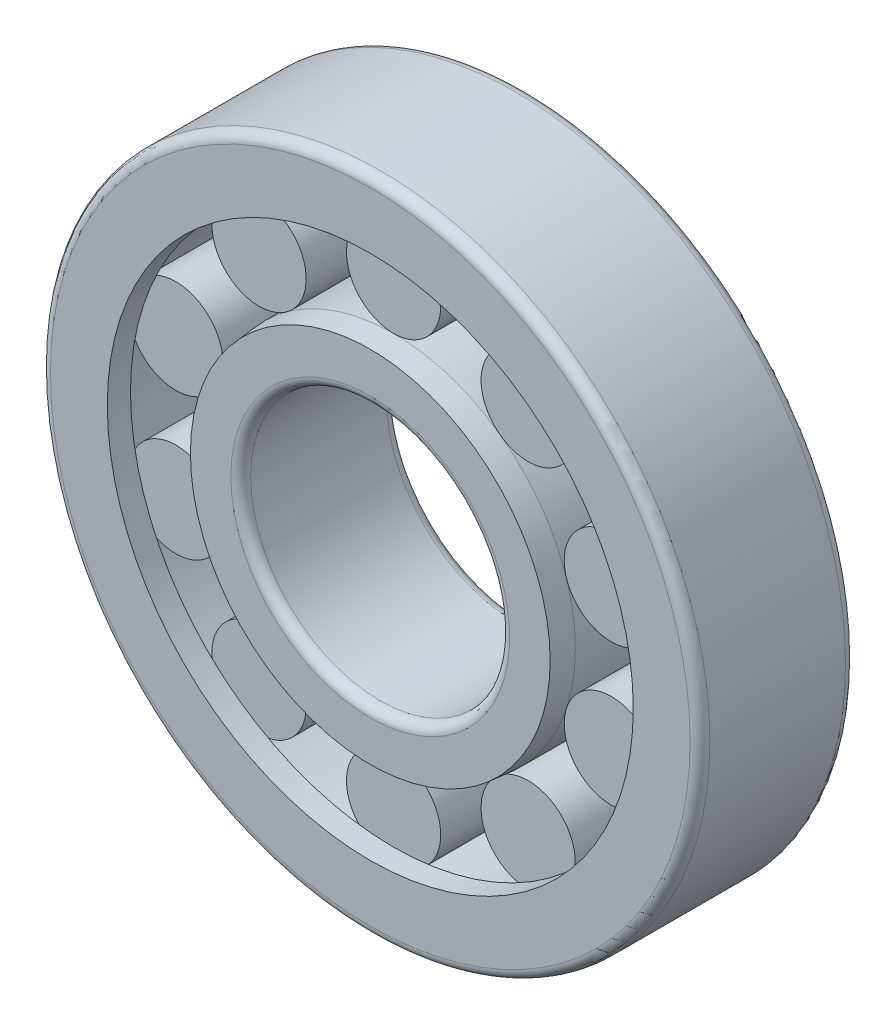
from build123d import *

# Parameters (mm, degrees)
BASESKE_W            = 23.1
BASESKE_H            = 10
FILLET1_R            = 2.1
CIRPATTERNBALL_COUNT = 10


with BuildPart() as part:
    # BaseSke → Roller (revolve)
    with BuildSketch(Plane(origin=(0, 0, 0), x_dir=(0, 0, -1), z_dir=(1, 0, 0)), mode=Mode.PRIVATE) as roller_sk:
        with Locations((0, 43.6)):
            Rectangle(BASESKE_W, BASESKE_H)
    roller = revolve(roller_sk.sketch.rotate(Axis((0, 48.6, 11.55), (0, 0, -1)), 270), axis=Axis((0, 48.6, 11.55), (0, 0, -1)))

    # OuterRaceSke → OuterRace (revolve)
    with BuildSketch(Plane(origin=(0, 0, 0), x_dir=(0, 0, -1), z_dir=(1, 0, 0)), mode=Mode.PRIVATE) as outerrace_sk:
        Polygon((-16.5, 70), (16.5, 70), (16.5, 55.833333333), (11.575, 55.833333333), (11.575, 58.58), (-11.575, 58.58), (-11.575, 55.833333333), (-16.5, 55.833333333), align=None)
    revolve(outerrace_sk.sketch.rotate(Axis((0, 0, 50.391616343), (0, 0, -1)), 90), axis=Axis((0, 0, 50.391616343), (0, 0, -1)))

    # InnerRaceSke → InnerRace (revolve)
    with BuildSketch(Plane(origin=(0, 0, 0), x_dir=(0, 0, -1), z_dir=(1, 0, 0)), mode=Mode.PRIVATE) as innerrace_sk:
        Polygon((-16.5, 27.5), (16.5, 27.5), (16.5, 41.666666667), (11.575, 41.666666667), (11.575, 38.62), (-11.575, 38.62), (-11.575, 41.666666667), (-16.5, 41.666666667), align=None)
    revolve(innerrace_sk.sketch.rotate(Axis((0, 0, 70.862590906), (0, 0, -1)), 90), axis=Axis((0, 0, 70.862590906), (0, 0, -1)))

    # Fillet1
    fillet1_edges = [part.edges().sort_by_distance(p)[0] for p in [
        (-70, 0, 16.5),
        (-70, 0, -16.5),
        (-27.5, 0, -16.5),
        (-27.5, 0, 16.5),
    ]]
    fillet(fillet1_edges, radius=FILLET1_R)

    # NJSke → NJ (revolve, cut)
    with BuildSketch(Plane(origin=(0, 0, 0), x_dir=(0, 0, -1), z_dir=(1, 0, 0)), mode=Mode.PRIVATE) as nj_sk:
        Polygon((16.5, 41.666666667), (11.575, 41.666666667), (11.575, 38.62), (16.5, 38.189118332), align=None)
    nj = revolve(nj_sk.sketch.rotate(Axis((0, 0, 35.607790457), (0, 0, -1)), 270), axis=Axis((0, 0, 35.607790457), (0, 0, -1)), mode=Mode.SUBTRACT)

    # NU: NJ across plane
    add(nj.mirror(Plane.XY), mode=Mode.SUBTRACT)

    # CirPatternBall: Roller ×10 about axis
    cirpatternball_axis = Axis((0, 0, 0), (0, 0, 1))
    for i in range(1, CIRPATTERNBALL_COUNT):
        add(roller.rotate(cirpatternball_axis, i * 360 / CIRPATTERNBALL_COUNT))


solid = part.part
